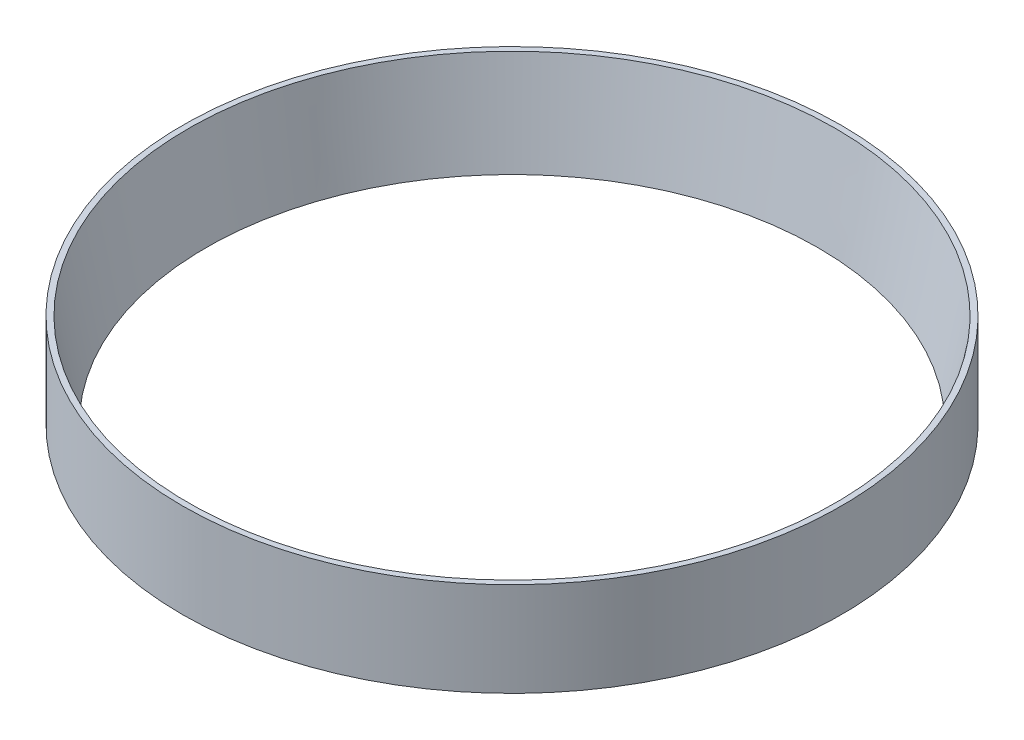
from build123d import *

# Parameters (mm, degrees)
SKETCH1_R           = 44.45
SKETCH1_R_2         = 41.275
BOSS_EXTRUDE1_DEPTH = 12.7


with BuildPart() as part:
    # Sketch1 → Boss-Extrude1 (new body)
    with BuildSketch(Plane(origin=(0, 0, 0), x_dir=(1, 0, 0), z_dir=(0, 1, 0))):
        with Locations(Location((0, 0, 0), (0, 0, 270))):
            Circle(SKETCH1_R)
        with Locations(Location((0, 0, 0), (0, 0, 270))):
            Circle(SKETCH1_R_2, mode=Mode.SUBTRACT)
    extrude(amount=BOSS_EXTRUDE1_DEPTH)

    # Sketch2 → Cut-Revolve1 (revolve, cut)
    with BuildSketch(Plane.XY, mode=Mode.PRIVATE) as cut_revolve1_sk:
        Polygon((-43.688, 12.7), (-41.275, 0), (-41.275, 12.7), align=None)
    revolve(cut_revolve1_sk.sketch.rotate(Axis((0, 0, 0), (0, 1, 0)), 270), axis=Axis((0, 0, 0), (0, 1, 0)), mode=Mode.SUBTRACT)


solid = part.part
